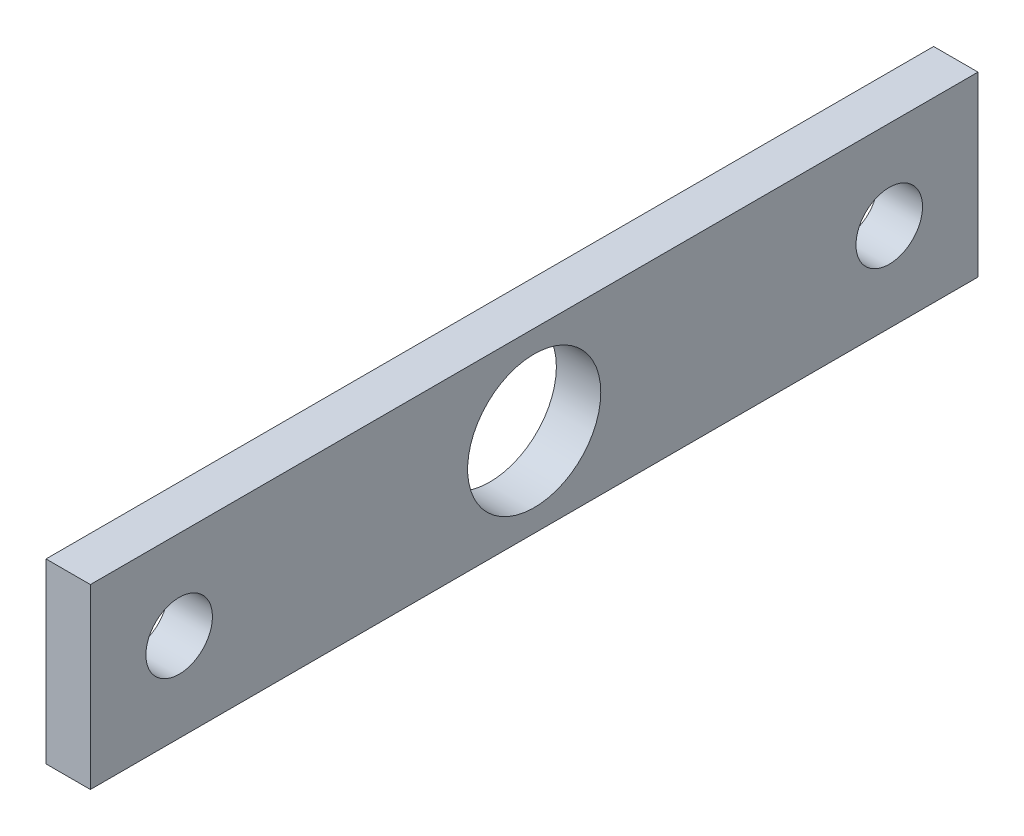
from build123d import *

# Parameters (mm, degrees)
SKETCH1_W           = 63.5
SKETCH1_H           = 12.7
SKETCH1_R           = 2.38125
SKETCH1_R_2         = 4.7625
BOSS_EXTRUDE1_DEPTH = 3.175


with BuildPart() as part:
    # Sketch1 → Boss-Extrude1 (new body)
    with BuildSketch(Plane(origin=(0, 0, 0), x_dir=(0, 0, -1), z_dir=(1, 0, 0))):
        with Locations((31.75, -6.35)):
            Rectangle(SKETCH1_W, SKETCH1_H)
        with Locations((6.35, -6.35)):
            Circle(SKETCH1_R, mode=Mode.SUBTRACT)
        with Locations((57.15, -6.35)):
            Circle(SKETCH1_R, mode=Mode.SUBTRACT)
        with Locations((31.75, -6.35)):
            Circle(SKETCH1_R_2, mode=Mode.SUBTRACT)
    extrude(amount=BOSS_EXTRUDE1_DEPTH)


solid = part.part
